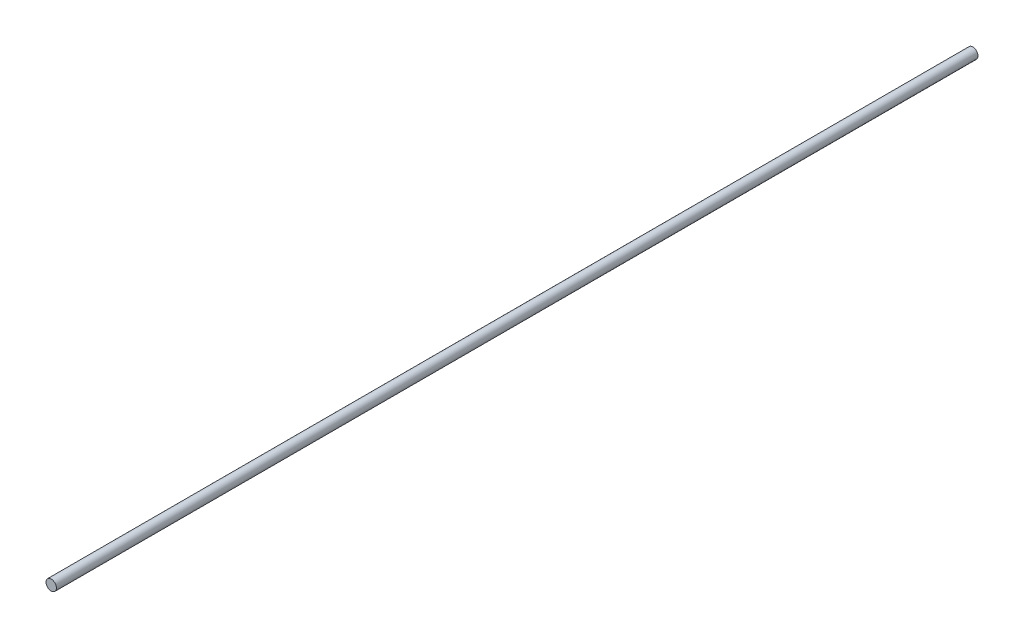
ISO-10303-21;
HEADER;
FILE_DESCRIPTION(('STEP AP214'),'2;1');
FILE_NAME('part.step','',(''),(''),'','','');
FILE_SCHEMA(('AUTOMOTIVE_DESIGN { 1 0 10303 214 1 1 1 1 }'));
ENDSEC;
DATA;
#1=APPLICATION_CONTEXT('core data for automotive mechanical design processes');
#2=APPLICATION_PROTOCOL_DEFINITION('international standard','automotive_design',2000,#1);
#3=PRODUCT_CONTEXT('',#1,'mechanical');
#4=PRODUCT('Part','Part','',(#3));
#5=PRODUCT_RELATED_PRODUCT_CATEGORY('part','',(#4));
#6=PRODUCT_DEFINITION_FORMATION('','',#4);
#7=PRODUCT_DEFINITION_CONTEXT('part definition',#1,'design');
#8=PRODUCT_DEFINITION('design','',#6,#7);
#9=PRODUCT_DEFINITION_SHAPE('','',#8);
#10=(LENGTH_UNIT() NAMED_UNIT(*) SI_UNIT(.MILLI.,.METRE.));
#11=(NAMED_UNIT(*) PLANE_ANGLE_UNIT() SI_UNIT($,.RADIAN.));
#12=(NAMED_UNIT(*) SI_UNIT($,.STERADIAN.) SOLID_ANGLE_UNIT());
#13=UNCERTAINTY_MEASURE_WITH_UNIT(LENGTH_MEASURE(1.E-05),#10,'distance_accuracy_value','');
#14=(GEOMETRIC_REPRESENTATION_CONTEXT(3) GLOBAL_UNCERTAINTY_ASSIGNED_CONTEXT((#13)) GLOBAL_UNIT_ASSIGNED_CONTEXT((#10,
#11,#12)) REPRESENTATION_CONTEXT('',''));
#15=CARTESIAN_POINT('',(0.,0.,0.));
#16=DIRECTION('',(0.,0.,1.));
#17=DIRECTION('',(1.,0.,0.));
#18=AXIS2_PLACEMENT_3D('',#15,#16,#17);
#19=CARTESIAN_POINT('',(0.,0.,-5300.));
#20=DIRECTION('',(0.,0.,1.));
#21=DIRECTION('',(1.,0.,0.));
#22=AXIS2_PLACEMENT_3D('',#19,#20,#21);
#23=CYLINDRICAL_SURFACE('',#22,30.);
#24=CARTESIAN_POINT('',(0.,0.,-5300.));
#25=DIRECTION('',(0.,0.,1.));
#26=DIRECTION('',(1.,0.,0.));
#27=AXIS2_PLACEMENT_3D('',#24,#25,#26);
#28=CIRCLE('',#27,30.);
#29=CARTESIAN_POINT('',(30.,0.,-5300.));
#30=VERTEX_POINT('',#29);
#31=EDGE_CURVE('E10',#30,#30,#28,.T.);
#32=ORIENTED_EDGE('',*,*,#31,.T.);
#33=EDGE_LOOP('',(#32));
#34=FACE_BOUND('',#33,.T.);
#35=CARTESIAN_POINT('',(0.,0.,0.));
#36=DIRECTION('',(0.,0.,1.));
#37=DIRECTION('',(1.,0.,0.));
#38=AXIS2_PLACEMENT_3D('',#35,#36,#37);
#39=CIRCLE('',#38,30.);
#40=CARTESIAN_POINT('',(30.,0.,0.));
#41=VERTEX_POINT('',#40);
#42=EDGE_CURVE('E40',#41,#41,#39,.T.);
#43=ORIENTED_EDGE('',*,*,#42,.F.);
#44=EDGE_LOOP('',(#43));
#45=FACE_BOUND('',#44,.T.);
#46=ADVANCED_FACE('F37',(#34,#45),#23,.T.);
#47=CARTESIAN_POINT('',(0.,0.,-5300.));
#48=DIRECTION('',(0.,0.,1.));
#49=DIRECTION('',(1.,0.,0.));
#50=AXIS2_PLACEMENT_3D('',#47,#48,#49);
#51=PLANE('',#50);
#52=ORIENTED_EDGE('',*,*,#31,.F.);
#53=EDGE_LOOP('',(#52));
#54=FACE_BOUND('',#53,.T.);
#55=ADVANCED_FACE('F54',(#54),#51,.F.);
#56=CARTESIAN_POINT('',(0.,0.,0.));
#57=DIRECTION('',(0.,0.,1.));
#58=DIRECTION('',(1.,0.,0.));
#59=AXIS2_PLACEMENT_3D('',#56,#57,#58);
#60=PLANE('',#59);
#61=ORIENTED_EDGE('',*,*,#42,.T.);
#62=EDGE_LOOP('',(#61));
#63=FACE_BOUND('',#62,.T.);
#64=ADVANCED_FACE('F51',(#63),#60,.T.);
#65=CLOSED_SHELL('',(#46,#55,#64));
#66=MANIFOLD_SOLID_BREP('B2',#65);
#67=ADVANCED_BREP_SHAPE_REPRESENTATION('',(#18,#66),#14);
#68=SHAPE_DEFINITION_REPRESENTATION(#9,#67);
ENDSEC;
END-ISO-10303-21;
